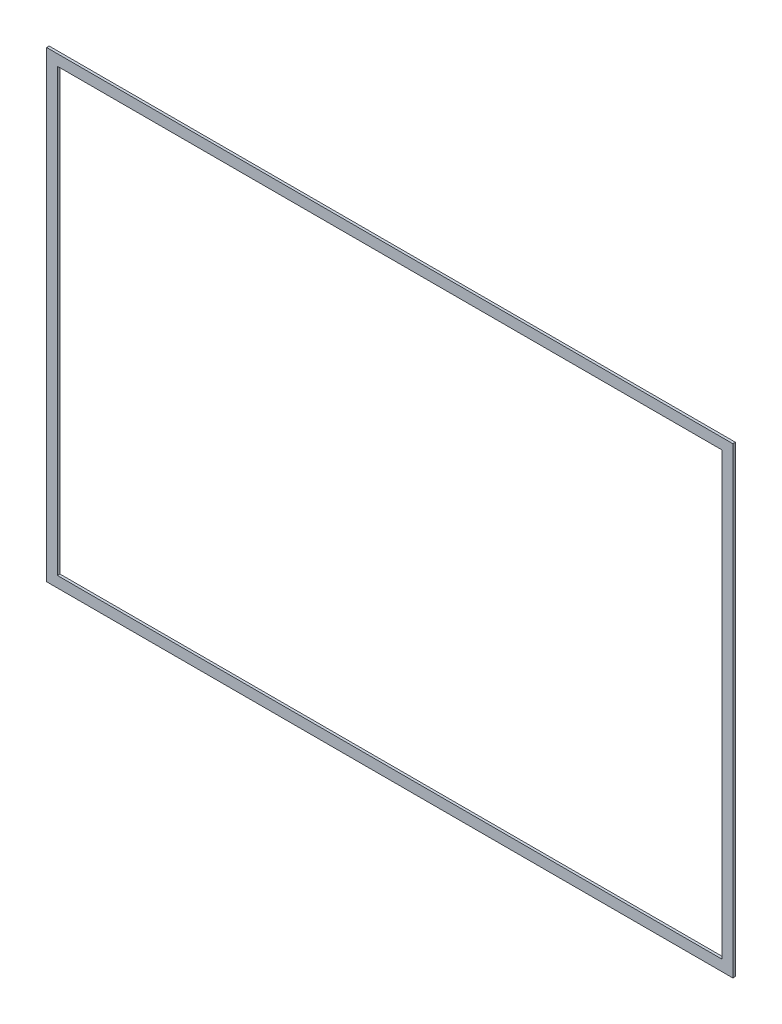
ISO-10303-21;
HEADER;
FILE_DESCRIPTION(('STEP AP214'),'2;1');
FILE_NAME('part.step','',(''),(''),'','','');
FILE_SCHEMA(('AUTOMOTIVE_DESIGN { 1 0 10303 214 1 1 1 1 }'));
ENDSEC;
DATA;
#1=APPLICATION_CONTEXT('core data for automotive mechanical design processes');
#2=APPLICATION_PROTOCOL_DEFINITION('international standard','automotive_design',2000,#1);
#3=PRODUCT_CONTEXT('',#1,'mechanical');
#4=PRODUCT('Part','Part','',(#3));
#5=PRODUCT_RELATED_PRODUCT_CATEGORY('part','',(#4));
#6=PRODUCT_DEFINITION_FORMATION('','',#4);
#7=PRODUCT_DEFINITION_CONTEXT('part definition',#1,'design');
#8=PRODUCT_DEFINITION('design','',#6,#7);
#9=PRODUCT_DEFINITION_SHAPE('','',#8);
#10=(LENGTH_UNIT() NAMED_UNIT(*) SI_UNIT(.MILLI.,.METRE.));
#11=(NAMED_UNIT(*) PLANE_ANGLE_UNIT() SI_UNIT($,.RADIAN.));
#12=(NAMED_UNIT(*) SI_UNIT($,.STERADIAN.) SOLID_ANGLE_UNIT());
#13=UNCERTAINTY_MEASURE_WITH_UNIT(LENGTH_MEASURE(1.E-05),#10,'distance_accuracy_value','');
#14=(GEOMETRIC_REPRESENTATION_CONTEXT(3) GLOBAL_UNCERTAINTY_ASSIGNED_CONTEXT((#13)) GLOBAL_UNIT_ASSIGNED_CONTEXT((#10,
#11,#12)) REPRESENTATION_CONTEXT('',''));
#15=CARTESIAN_POINT('',(0.,0.,0.));
#16=DIRECTION('',(0.,0.,1.));
#17=DIRECTION('',(1.,0.,0.));
#18=AXIS2_PLACEMENT_3D('',#15,#16,#17);
#19=CARTESIAN_POINT('',(-1.11022302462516E-13,638.5,3.5));
#20=DIRECTION('',(0.,0.,-1.));
#21=DIRECTION('',(-1.,0.,0.));
#22=AXIS2_PLACEMENT_3D('',#19,#20,#21);
#23=PLANE('',#22);
#24=DIRECTION('',(0.,-1.,0.));
#25=VECTOR('',#24,1.);
#26=CARTESIAN_POINT('',(0.,0.,3.5));
#27=LINE('',#26,#25);
#28=CARTESIAN_POINT('',(-1.11022302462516E-13,638.5,3.5));
#29=VERTEX_POINT('',#28);
#30=CARTESIAN_POINT('',(0.,0.,3.5));
#31=VERTEX_POINT('',#30);
#32=EDGE_CURVE('E132',#29,#31,#27,.T.);
#33=ORIENTED_EDGE('',*,*,#32,.T.);
#34=DIRECTION('',(1.,0.,0.));
#35=VECTOR('',#34,1.);
#36=CARTESIAN_POINT('',(0.,0.,3.5));
#37=LINE('',#36,#35);
#38=CARTESIAN_POINT('',(947.,0.,3.5));
#39=VERTEX_POINT('',#38);
#40=EDGE_CURVE('E135',#31,#39,#37,.T.);
#41=ORIENTED_EDGE('',*,*,#40,.T.);
#42=DIRECTION('',(0.,1.,0.));
#43=VECTOR('',#42,1.);
#44=CARTESIAN_POINT('',(947.,0.,3.5));
#45=LINE('',#44,#43);
#46=CARTESIAN_POINT('',(947.,638.5,3.5));
#47=VERTEX_POINT('',#46);
#48=EDGE_CURVE('E138',#39,#47,#45,.T.);
#49=ORIENTED_EDGE('',*,*,#48,.T.);
#50=DIRECTION('',(-1.,0.,0.));
#51=VECTOR('',#50,1.);
#52=CARTESIAN_POINT('',(-1.11022302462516E-13,638.5,3.5));
#53=LINE('',#52,#51);
#54=EDGE_CURVE('E140',#47,#29,#53,.T.);
#55=ORIENTED_EDGE('',*,*,#54,.T.);
#56=EDGE_LOOP('',(#33,#41,#49,#55));
#57=FACE_BOUND('',#56,.T.);
#58=DIRECTION('',(0.,-1.,0.));
#59=VECTOR('',#58,1.);
#60=CARTESIAN_POINT('',(15.,15.,3.5));
#61=LINE('',#60,#59);
#62=CARTESIAN_POINT('',(14.9999999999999,623.5,3.5));
#63=VERTEX_POINT('',#62);
#64=CARTESIAN_POINT('',(15.,15.,3.5));
#65=VERTEX_POINT('',#64);
#66=EDGE_CURVE('E96',#63,#65,#61,.T.);
#67=ORIENTED_EDGE('',*,*,#66,.F.);
#68=DIRECTION('',(-1.,0.,0.));
#69=VECTOR('',#68,1.);
#70=CARTESIAN_POINT('',(14.9999999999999,623.5,3.5));
#71=LINE('',#70,#69);
#72=CARTESIAN_POINT('',(932.,623.5,3.5));
#73=VERTEX_POINT('',#72);
#74=EDGE_CURVE('E118',#73,#63,#71,.T.);
#75=ORIENTED_EDGE('',*,*,#74,.F.);
#76=DIRECTION('',(0.,1.,0.));
#77=VECTOR('',#76,1.);
#78=CARTESIAN_POINT('',(932.,15.,3.5));
#79=LINE('',#78,#77);
#80=CARTESIAN_POINT('',(932.,15.,3.5));
#81=VERTEX_POINT('',#80);
#82=EDGE_CURVE('E116',#81,#73,#79,.T.);
#83=ORIENTED_EDGE('',*,*,#82,.F.);
#84=DIRECTION('',(1.,0.,0.));
#85=VECTOR('',#84,1.);
#86=CARTESIAN_POINT('',(15.,15.,3.5));
#87=LINE('',#86,#85);
#88=EDGE_CURVE('E104',#65,#81,#87,.T.);
#89=ORIENTED_EDGE('',*,*,#88,.F.);
#90=EDGE_LOOP('',(#67,#75,#83,#89));
#91=FACE_BOUND('',#90,.T.);
#92=ADVANCED_FACE('F31',(#57,#91),#23,.F.);
#93=CARTESIAN_POINT('',(-1.11022302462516E-13,638.5,0.));
#94=DIRECTION('',(0.,0.,-1.));
#95=DIRECTION('',(-1.,0.,0.));
#96=AXIS2_PLACEMENT_3D('',#93,#94,#95);
#97=PLANE('',#96);
#98=DIRECTION('',(0.,-1.,0.));
#99=VECTOR('',#98,1.);
#100=CARTESIAN_POINT('',(0.,0.,0.));
#101=LINE('',#100,#99);
#102=CARTESIAN_POINT('',(-1.11022302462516E-13,638.5,0.));
#103=VERTEX_POINT('',#102);
#104=CARTESIAN_POINT('',(0.,0.,0.));
#105=VERTEX_POINT('',#104);
#106=EDGE_CURVE('E112',#103,#105,#101,.T.);
#107=ORIENTED_EDGE('',*,*,#106,.F.);
#108=DIRECTION('',(-1.,0.,0.));
#109=VECTOR('',#108,1.);
#110=CARTESIAN_POINT('',(-1.11022302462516E-13,638.5,0.));
#111=LINE('',#110,#109);
#112=CARTESIAN_POINT('',(947.,638.5,0.));
#113=VERTEX_POINT('',#112);
#114=EDGE_CURVE('E136',#113,#103,#111,.T.);
#115=ORIENTED_EDGE('',*,*,#114,.F.);
#116=DIRECTION('',(0.,1.,0.));
#117=VECTOR('',#116,1.);
#118=CARTESIAN_POINT('',(947.,0.,0.));
#119=LINE('',#118,#117);
#120=CARTESIAN_POINT('',(947.,0.,0.));
#121=VERTEX_POINT('',#120);
#122=EDGE_CURVE('E147',#121,#113,#119,.T.);
#123=ORIENTED_EDGE('',*,*,#122,.F.);
#124=DIRECTION('',(1.,0.,0.));
#125=VECTOR('',#124,1.);
#126=CARTESIAN_POINT('',(0.,0.,0.));
#127=LINE('',#126,#125);
#128=EDGE_CURVE('E145',#105,#121,#127,.T.);
#129=ORIENTED_EDGE('',*,*,#128,.F.);
#130=EDGE_LOOP('',(#107,#115,#123,#129));
#131=FACE_BOUND('',#130,.T.);
#132=DIRECTION('',(-1.,0.,0.));
#133=VECTOR('',#132,1.);
#134=CARTESIAN_POINT('',(14.9999999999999,623.5,0.));
#135=LINE('',#134,#133);
#136=CARTESIAN_POINT('',(932.,623.5,0.));
#137=VERTEX_POINT('',#136);
#138=CARTESIAN_POINT('',(14.9999999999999,623.5,0.));
#139=VERTEX_POINT('',#138);
#140=EDGE_CURVE('E105',#137,#139,#135,.T.);
#141=ORIENTED_EDGE('',*,*,#140,.T.);
#142=DIRECTION('',(0.,-1.,0.));
#143=VECTOR('',#142,1.);
#144=CARTESIAN_POINT('',(15.,15.,0.));
#145=LINE('',#144,#143);
#146=CARTESIAN_POINT('',(15.,15.,0.));
#147=VERTEX_POINT('',#146);
#148=EDGE_CURVE('E54',#139,#147,#145,.T.);
#149=ORIENTED_EDGE('',*,*,#148,.T.);
#150=DIRECTION('',(1.,0.,0.));
#151=VECTOR('',#150,1.);
#152=CARTESIAN_POINT('',(15.,15.,0.));
#153=LINE('',#152,#151);
#154=CARTESIAN_POINT('',(932.,15.,0.));
#155=VERTEX_POINT('',#154);
#156=EDGE_CURVE('E111',#147,#155,#153,.T.);
#157=ORIENTED_EDGE('',*,*,#156,.T.);
#158=DIRECTION('',(0.,1.,0.));
#159=VECTOR('',#158,1.);
#160=CARTESIAN_POINT('',(932.,15.,0.));
#161=LINE('',#160,#159);
#162=EDGE_CURVE('E124',#155,#137,#161,.T.);
#163=ORIENTED_EDGE('',*,*,#162,.T.);
#164=EDGE_LOOP('',(#141,#149,#157,#163));
#165=FACE_BOUND('',#164,.T.);
#166=ADVANCED_FACE('F165',(#131,#165),#97,.T.);
#167=CARTESIAN_POINT('',(0.,0.,3.5));
#168=DIRECTION('',(1.,0.,0.));
#169=DIRECTION('',(0.,1.,0.));
#170=AXIS2_PLACEMENT_3D('',#167,#168,#169);
#171=PLANE('',#170);
#172=ORIENTED_EDGE('',*,*,#106,.T.);
#173=DIRECTION('',(0.,0.,-1.));
#174=VECTOR('',#173,1.);
#175=CARTESIAN_POINT('',(0.,0.,3.5));
#176=LINE('',#175,#174);
#177=EDGE_CURVE('E11',#31,#105,#176,.T.);
#178=ORIENTED_EDGE('',*,*,#177,.F.);
#179=ORIENTED_EDGE('',*,*,#32,.F.);
#180=DIRECTION('',(0.,0.,-1.));
#181=VECTOR('',#180,1.);
#182=CARTESIAN_POINT('',(-1.11022302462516E-13,638.5,3.5));
#183=LINE('',#182,#181);
#184=EDGE_CURVE('E142',#29,#103,#183,.T.);
#185=ORIENTED_EDGE('',*,*,#184,.T.);
#186=EDGE_LOOP('',(#172,#178,#179,#185));
#187=FACE_BOUND('',#186,.T.);
#188=ADVANCED_FACE('F33',(#187),#171,.F.);
#189=CARTESIAN_POINT('',(0.,0.,3.5));
#190=DIRECTION('',(0.,1.,0.));
#191=DIRECTION('',(0.,0.,1.));
#192=AXIS2_PLACEMENT_3D('',#189,#190,#191);
#193=PLANE('',#192);
#194=ORIENTED_EDGE('',*,*,#128,.T.);
#195=DIRECTION('',(0.,0.,-1.));
#196=VECTOR('',#195,1.);
#197=CARTESIAN_POINT('',(947.,0.,3.5));
#198=LINE('',#197,#196);
#199=EDGE_CURVE('E39',#39,#121,#198,.T.);
#200=ORIENTED_EDGE('',*,*,#199,.F.);
#201=ORIENTED_EDGE('',*,*,#40,.F.);
#202=ORIENTED_EDGE('',*,*,#177,.T.);
#203=EDGE_LOOP('',(#194,#200,#201,#202));
#204=FACE_BOUND('',#203,.T.);
#205=ADVANCED_FACE('F175',(#204),#193,.F.);
#206=CARTESIAN_POINT('',(947.,0.,3.5));
#207=DIRECTION('',(-1.,0.,0.));
#208=DIRECTION('',(0.,-1.,0.));
#209=AXIS2_PLACEMENT_3D('',#206,#207,#208);
#210=PLANE('',#209);
#211=ORIENTED_EDGE('',*,*,#122,.T.);
#212=DIRECTION('',(0.,0.,-1.));
#213=VECTOR('',#212,1.);
#214=CARTESIAN_POINT('',(947.,638.5,3.5));
#215=LINE('',#214,#213);
#216=EDGE_CURVE('E152',#47,#113,#215,.T.);
#217=ORIENTED_EDGE('',*,*,#216,.F.);
#218=ORIENTED_EDGE('',*,*,#48,.F.);
#219=ORIENTED_EDGE('',*,*,#199,.T.);
#220=EDGE_LOOP('',(#211,#217,#218,#219));
#221=FACE_BOUND('',#220,.T.);
#222=ADVANCED_FACE('F159',(#221),#210,.F.);
#223=CARTESIAN_POINT('',(-1.11022302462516E-13,638.5,3.5));
#224=DIRECTION('',(0.,-1.,0.));
#225=DIRECTION('',(0.,0.,-1.));
#226=AXIS2_PLACEMENT_3D('',#223,#224,#225);
#227=PLANE('',#226);
#228=ORIENTED_EDGE('',*,*,#114,.T.);
#229=ORIENTED_EDGE('',*,*,#184,.F.);
#230=ORIENTED_EDGE('',*,*,#54,.F.);
#231=ORIENTED_EDGE('',*,*,#216,.T.);
#232=EDGE_LOOP('',(#228,#229,#230,#231));
#233=FACE_BOUND('',#232,.T.);
#234=ADVANCED_FACE('F169',(#233),#227,.F.);
#235=CARTESIAN_POINT('',(15.,15.,3.5));
#236=DIRECTION('',(1.,0.,0.));
#237=DIRECTION('',(0.,1.,0.));
#238=AXIS2_PLACEMENT_3D('',#235,#236,#237);
#239=PLANE('',#238);
#240=ORIENTED_EDGE('',*,*,#148,.F.);
#241=DIRECTION('',(0.,0.,-1.));
#242=VECTOR('',#241,1.);
#243=CARTESIAN_POINT('',(14.9999999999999,623.5,3.5));
#244=LINE('',#243,#242);
#245=EDGE_CURVE('E100',#63,#139,#244,.T.);
#246=ORIENTED_EDGE('',*,*,#245,.F.);
#247=ORIENTED_EDGE('',*,*,#66,.T.);
#248=DIRECTION('',(0.,0.,-1.));
#249=VECTOR('',#248,1.);
#250=CARTESIAN_POINT('',(15.,15.,3.5));
#251=LINE('',#250,#249);
#252=EDGE_CURVE('E99',#65,#147,#251,.T.);
#253=ORIENTED_EDGE('',*,*,#252,.T.);
#254=EDGE_LOOP('',(#240,#246,#247,#253));
#255=FACE_BOUND('',#254,.T.);
#256=ADVANCED_FACE('F98',(#255),#239,.T.);
#257=CARTESIAN_POINT('',(15.,15.,3.5));
#258=DIRECTION('',(0.,1.,0.));
#259=DIRECTION('',(0.,0.,1.));
#260=AXIS2_PLACEMENT_3D('',#257,#258,#259);
#261=PLANE('',#260);
#262=ORIENTED_EDGE('',*,*,#156,.F.);
#263=ORIENTED_EDGE('',*,*,#252,.F.);
#264=ORIENTED_EDGE('',*,*,#88,.T.);
#265=DIRECTION('',(0.,0.,-1.));
#266=VECTOR('',#265,1.);
#267=CARTESIAN_POINT('',(932.,15.,3.5));
#268=LINE('',#267,#266);
#269=EDGE_CURVE('E113',#81,#155,#268,.T.);
#270=ORIENTED_EDGE('',*,*,#269,.T.);
#271=EDGE_LOOP('',(#262,#263,#264,#270));
#272=FACE_BOUND('',#271,.T.);
#273=ADVANCED_FACE('F108',(#272),#261,.T.);
#274=CARTESIAN_POINT('',(932.,15.,3.5));
#275=DIRECTION('',(-1.,0.,0.));
#276=DIRECTION('',(0.,-1.,0.));
#277=AXIS2_PLACEMENT_3D('',#274,#275,#276);
#278=PLANE('',#277);
#279=ORIENTED_EDGE('',*,*,#162,.F.);
#280=ORIENTED_EDGE('',*,*,#269,.F.);
#281=ORIENTED_EDGE('',*,*,#82,.T.);
#282=DIRECTION('',(0.,0.,-1.));
#283=VECTOR('',#282,1.);
#284=CARTESIAN_POINT('',(932.,623.5,3.5));
#285=LINE('',#284,#283);
#286=EDGE_CURVE('E46',#73,#137,#285,.T.);
#287=ORIENTED_EDGE('',*,*,#286,.T.);
#288=EDGE_LOOP('',(#279,#280,#281,#287));
#289=FACE_BOUND('',#288,.T.);
#290=ADVANCED_FACE('F198',(#289),#278,.T.);
#291=CARTESIAN_POINT('',(14.9999999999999,623.5,3.5));
#292=DIRECTION('',(0.,-1.,0.));
#293=DIRECTION('',(0.,0.,-1.));
#294=AXIS2_PLACEMENT_3D('',#291,#292,#293);
#295=PLANE('',#294);
#296=ORIENTED_EDGE('',*,*,#140,.F.);
#297=ORIENTED_EDGE('',*,*,#286,.F.);
#298=ORIENTED_EDGE('',*,*,#74,.T.);
#299=ORIENTED_EDGE('',*,*,#245,.T.);
#300=EDGE_LOOP('',(#296,#297,#298,#299));
#301=FACE_BOUND('',#300,.T.);
#302=ADVANCED_FACE('F202',(#301),#295,.T.);
#303=CLOSED_SHELL('',(#92,#166,#188,#205,#222,#234,#256,#273,#290,#302));
#304=MANIFOLD_SOLID_BREP('B2',#303);
#305=ADVANCED_BREP_SHAPE_REPRESENTATION('',(#18,#304),#14);
#306=SHAPE_DEFINITION_REPRESENTATION(#9,#305);
ENDSEC;
END-ISO-10303-21;
